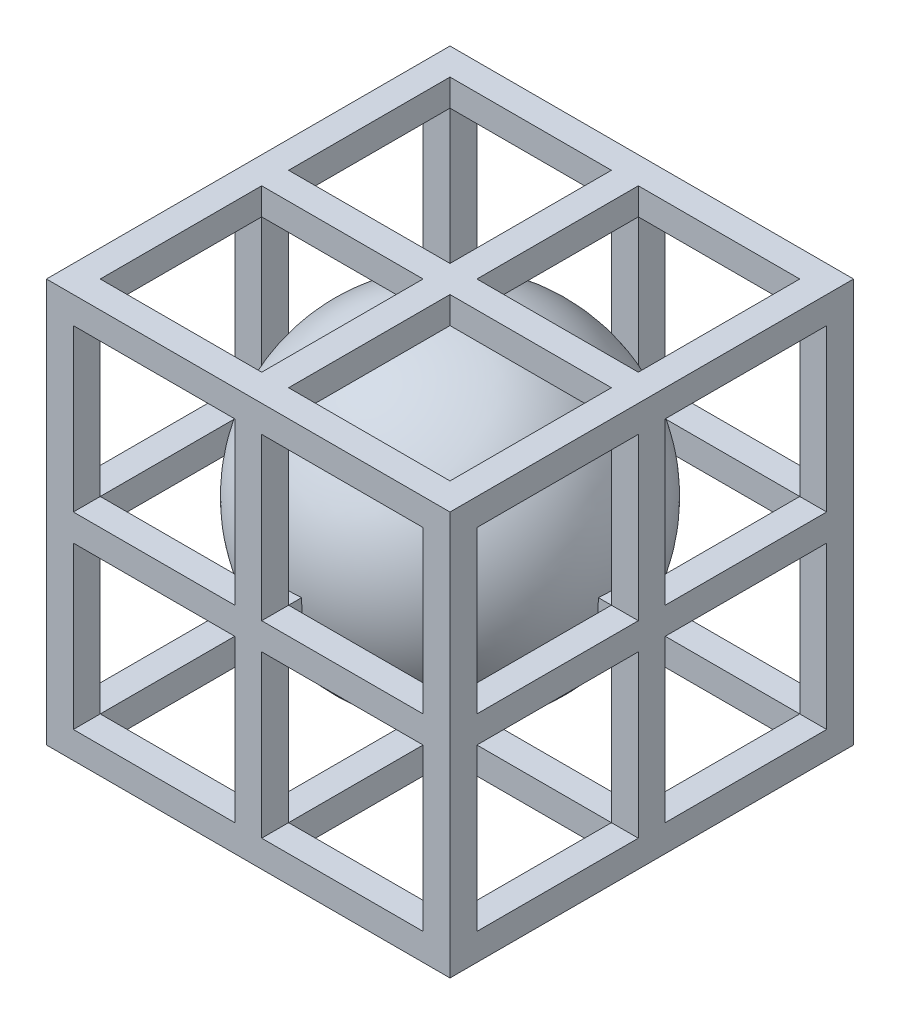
from build123d import *

# Parameters (mm, degrees)
CROQUIS1_W              = 30
CROQUIS1_H              = 30
CROQUIS1_W_2            = 12
CROQUIS1_H_2            = 12
SALIENTE_EXTRUIR1_DEPTH = 30
CROQUIS2_W              = 12
CROQUIS2_H              = 12
CORTAR_EXTRUIR1_DEPTH   = 50
CROQUIS3_W              = 12
CROQUIS3_H              = 12
CORTAR_EXTRUIR2_DEPTH   = 50


with BuildPart() as part:
    # Croquis1 → Saliente-Extruir1 (new body)
    with BuildSketch(Plane(origin=(0, 0, 0), x_dir=(1, 0, 0), z_dir=(0, 1, 0))):
        with Locations((12.227964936, 13.289667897)):
            Rectangle(CROQUIS1_W, CROQUIS1_H)
        with Locations((5.227964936, 20.289667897)):
            Rectangle(CROQUIS1_W_2, CROQUIS1_H_2, mode=Mode.SUBTRACT)
        with Locations((5.227964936, 6.289667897)):
            Rectangle(CROQUIS1_W_2, CROQUIS1_H_2, mode=Mode.SUBTRACT)
        with Locations((19.227964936, 20.289667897)):
            Rectangle(CROQUIS1_W_2, CROQUIS1_H_2, mode=Mode.SUBTRACT)
        with Locations((19.227964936, 6.289667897)):
            Rectangle(CROQUIS1_W_2, CROQUIS1_H_2, mode=Mode.SUBTRACT)
    extrude(amount=SALIENTE_EXTRUIR1_DEPTH)

    # Croquis2 → Cortar-Extruir1 (cut)
    with BuildSketch(Plane.XY.offset(1.710332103)):
        with Locations((5.227964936, 22)):
            Rectangle(CROQUIS2_W, CROQUIS2_H)
        with Locations((19.227964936, 22)):
            Rectangle(CROQUIS2_W, CROQUIS2_H)
        with Locations((5.227964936, 8)):
            Rectangle(CROQUIS2_W, CROQUIS2_H)
        with Locations((19.227964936, 8)):
            Rectangle(CROQUIS2_W, CROQUIS2_H)
    extrude(amount=-CORTAR_EXTRUIR1_DEPTH, mode=Mode.SUBTRACT)

    # Croquis3 → Cortar-Extruir2 (cut)
    with BuildSketch(Plane(origin=(27.227964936, 0, 0), x_dir=(0, 0, -1), z_dir=(1, 0, 0))):
        with Locations((6.289667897, 22)):
            Rectangle(CROQUIS3_W, CROQUIS3_H)
        with Locations((20.289667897, 22)):
            Rectangle(CROQUIS3_W, CROQUIS3_H)
        with Locations((20.289667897, 8)):
            Rectangle(CROQUIS3_W, CROQUIS3_H)
        with Locations((6.289667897, 8)):
            Rectangle(CROQUIS3_W, CROQUIS3_H)
    extrude(amount=-CORTAR_EXTRUIR2_DEPTH, mode=Mode.SUBTRACT)

    # Croquis4 → Revoluci_n1 (revolve)
    with BuildSketch(Plane(origin=(0, 16, 0), x_dir=(1, 0, 0), z_dir=(0, 1, 0))):
        with BuildLine():
            Line((10.520858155, 1.339920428), (10.945122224, 4.309768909))
            ThreePointArc((10.945122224, 4.309768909), (21.207863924, 12.006825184), (13.510807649, 22.269566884))
            Line((13.510807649, 22.269566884), (13.935071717, 25.239415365))
            ThreePointArc((13.935071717, 25.239415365), (24.177712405, 11.582561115), (10.520858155, 1.339920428))
        make_face()
    revolve(axis=Axis((13.510807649, 16, -22.269566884), (0.1414213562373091, 0, -0.9899494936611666)))


solid = part.part
